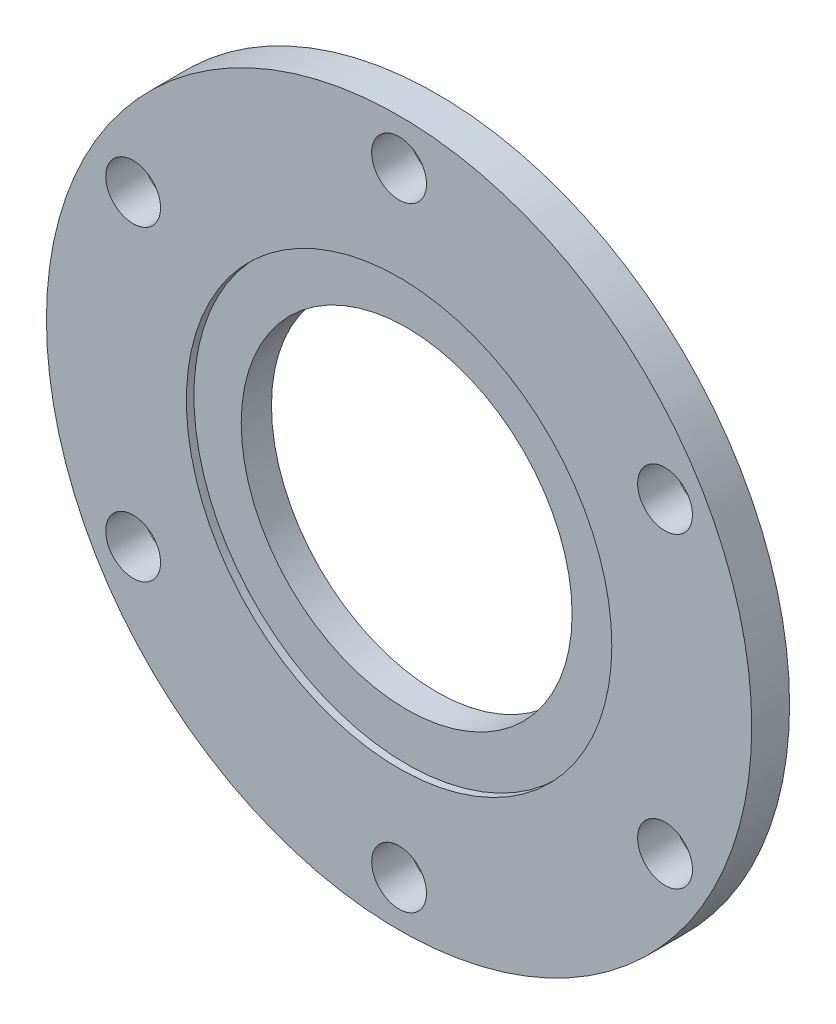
from build123d import *

# Parameters (mm, degrees)
SKETCH1_R           = 23.6855
SKETCH1_R_2         = 11.1125
BOSS_EXTRUDE1_DEPTH = 2.54
SKETCH2_R           = 14.2875
CUT_EXTRUDE1_DEPTH  = 0.508
SKETCH3_R           = 1.8415
CUT_EXTRUDE2_DEPTH  = 34.592520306
CIRPATTERN1_COUNT   = 6


with BuildPart() as part:
    # Sketch1 → Boss-Extrude1 (new body)
    with BuildSketch(Plane.XY):
        Circle(SKETCH1_R)
        Circle(SKETCH1_R_2, mode=Mode.SUBTRACT)
    extrude(amount=BOSS_EXTRUDE1_DEPTH)

    # Sketch2 → Cut-Extrude1 (cut)
    with BuildSketch(Plane.XY.offset(2.54)):
        Circle(SKETCH2_R)
    extrude(amount=-CUT_EXTRUDE1_DEPTH, mode=Mode.SUBTRACT)

    # Sketch3 → Cut-Extrude2 (cut, through all)
    with BuildSketch(Plane.XY.offset(2.54)):
        with Locations((0, 20.6248)):
            Circle(SKETCH3_R)
    cut_extrude2 = extrude(amount=-CUT_EXTRUDE2_DEPTH, mode=Mode.SUBTRACT)

    # CirPattern1: Cut-Extrude2 ×6 about axis
    cirpattern1_axis = Axis((0, 0, 0), (0, 0, 1))
    for i in range(1, CIRPATTERN1_COUNT):
        add(cut_extrude2.rotate(cirpattern1_axis, i * 360 / CIRPATTERN1_COUNT), mode=Mode.SUBTRACT)


solid = part.part
